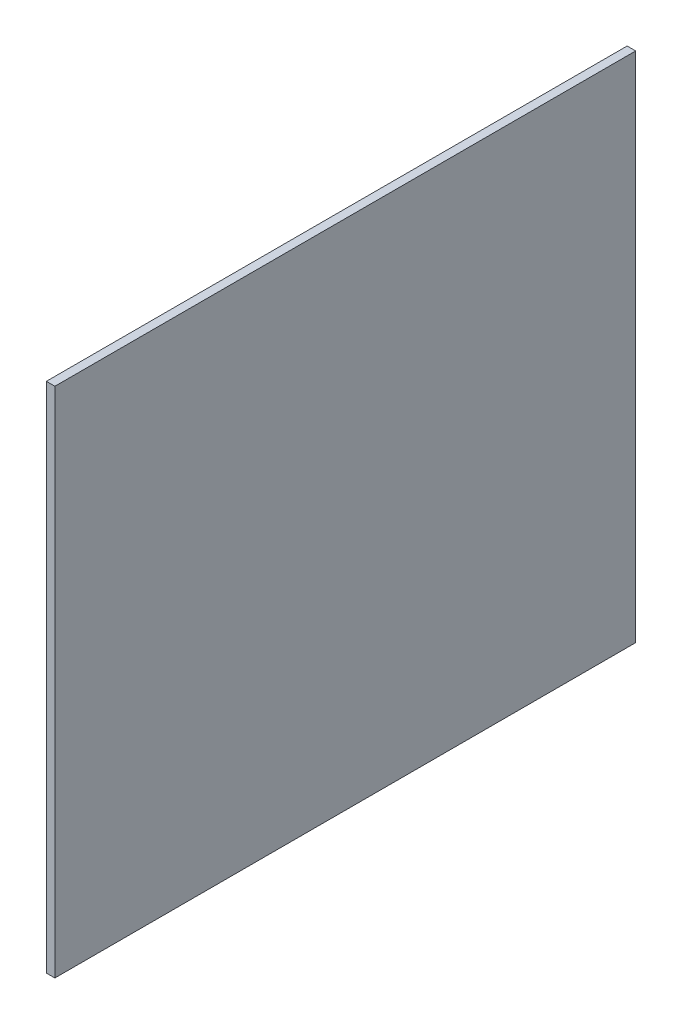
ISO-10303-21;
HEADER;
FILE_DESCRIPTION(('STEP AP214'),'2;1');
FILE_NAME('part.step','',(''),(''),'','','');
FILE_SCHEMA(('AUTOMOTIVE_DESIGN { 1 0 10303 214 1 1 1 1 }'));
ENDSEC;
DATA;
#1=APPLICATION_CONTEXT('core data for automotive mechanical design processes');
#2=APPLICATION_PROTOCOL_DEFINITION('international standard','automotive_design',2000,#1);
#3=PRODUCT_CONTEXT('',#1,'mechanical');
#4=PRODUCT('Part','Part','',(#3));
#5=PRODUCT_RELATED_PRODUCT_CATEGORY('part','',(#4));
#6=PRODUCT_DEFINITION_FORMATION('','',#4);
#7=PRODUCT_DEFINITION_CONTEXT('part definition',#1,'design');
#8=PRODUCT_DEFINITION('design','',#6,#7);
#9=PRODUCT_DEFINITION_SHAPE('','',#8);
#10=(LENGTH_UNIT() NAMED_UNIT(*) SI_UNIT(.MILLI.,.METRE.));
#11=(NAMED_UNIT(*) PLANE_ANGLE_UNIT() SI_UNIT($,.RADIAN.));
#12=(NAMED_UNIT(*) SI_UNIT($,.STERADIAN.) SOLID_ANGLE_UNIT());
#13=UNCERTAINTY_MEASURE_WITH_UNIT(LENGTH_MEASURE(1.E-05),#10,'distance_accuracy_value','');
#14=(GEOMETRIC_REPRESENTATION_CONTEXT(3) GLOBAL_UNCERTAINTY_ASSIGNED_CONTEXT((#13)) GLOBAL_UNIT_ASSIGNED_CONTEXT((#10,
#11,#12)) REPRESENTATION_CONTEXT('',''));
#15=CARTESIAN_POINT('',(0.,0.,0.));
#16=DIRECTION('',(0.,0.,1.));
#17=DIRECTION('',(1.,0.,0.));
#18=AXIS2_PLACEMENT_3D('',#15,#16,#17);
#19=CARTESIAN_POINT('',(-1.47104550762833E-12,190.5,215.9));
#20=DIRECTION('',(0.,-1.,0.));
#21=DIRECTION('',(0.,0.,-1.));
#22=AXIS2_PLACEMENT_3D('',#19,#20,#21);
#23=PLANE('',#22);
#24=DIRECTION('',(-1.,0.,0.));
#25=VECTOR('',#24,1.);
#26=CARTESIAN_POINT('',(0.,190.499999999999,-215.9));
#27=LINE('',#26,#25);
#28=CARTESIAN_POINT('',(6.35000000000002,190.499999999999,-215.9));
#29=VERTEX_POINT('',#28);
#30=CARTESIAN_POINT('',(0.,190.499999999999,-215.9));
#31=VERTEX_POINT('',#30);
#32=EDGE_CURVE('E94',#29,#31,#27,.T.);
#33=ORIENTED_EDGE('',*,*,#32,.T.);
#34=DIRECTION('',(0.,0.,-1.));
#35=VECTOR('',#34,1.);
#36=CARTESIAN_POINT('',(-1.47104550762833E-12,190.5,215.9));
#37=LINE('',#36,#35);
#38=CARTESIAN_POINT('',(-1.47104550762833E-12,190.5,215.9));
#39=VERTEX_POINT('',#38);
#40=EDGE_CURVE('E11',#39,#31,#37,.T.);
#41=ORIENTED_EDGE('',*,*,#40,.F.);
#42=DIRECTION('',(-1.,0.,0.));
#43=VECTOR('',#42,1.);
#44=CARTESIAN_POINT('',(-1.47104550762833E-12,190.5,215.9));
#45=LINE('',#44,#43);
#46=CARTESIAN_POINT('',(6.34999999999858,190.5,215.9));
#47=VERTEX_POINT('',#46);
#48=EDGE_CURVE('E82',#47,#39,#45,.T.);
#49=ORIENTED_EDGE('',*,*,#48,.F.);
#50=DIRECTION('',(0.,0.,-1.));
#51=VECTOR('',#50,1.);
#52=CARTESIAN_POINT('',(6.34999999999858,190.5,215.9));
#53=LINE('',#52,#51);
#54=EDGE_CURVE('E90',#47,#29,#53,.T.);
#55=ORIENTED_EDGE('',*,*,#54,.T.);
#56=EDGE_LOOP('',(#33,#41,#49,#55));
#57=FACE_BOUND('',#56,.T.);
#58=ADVANCED_FACE('F31',(#57),#23,.F.);
#59=CARTESIAN_POINT('',(-1.47104550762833E-12,-190.5,215.900000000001));
#60=DIRECTION('',(1.,0.,0.));
#61=DIRECTION('',(0.,0.,-1.));
#62=AXIS2_PLACEMENT_3D('',#59,#60,#61);
#63=PLANE('',#62);
#64=DIRECTION('',(0.,-1.,0.));
#65=VECTOR('',#64,1.);
#66=CARTESIAN_POINT('',(0.,-190.500000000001,-215.899999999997));
#67=LINE('',#66,#65);
#68=CARTESIAN_POINT('',(0.,-190.500000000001,-215.899999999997));
#69=VERTEX_POINT('',#68);
#70=EDGE_CURVE('E86',#31,#69,#67,.T.);
#71=ORIENTED_EDGE('',*,*,#70,.T.);
#72=DIRECTION('',(0.,0.,-1.));
#73=VECTOR('',#72,1.);
#74=CARTESIAN_POINT('',(-1.47104550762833E-12,-190.5,215.900000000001));
#75=LINE('',#74,#73);
#76=CARTESIAN_POINT('',(-1.47104550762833E-12,-190.5,215.900000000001));
#77=VERTEX_POINT('',#76);
#78=EDGE_CURVE('E39',#77,#69,#75,.T.);
#79=ORIENTED_EDGE('',*,*,#78,.F.);
#80=DIRECTION('',(0.,-1.,0.));
#81=VECTOR('',#80,1.);
#82=CARTESIAN_POINT('',(-1.47104550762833E-12,-190.5,215.900000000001));
#83=LINE('',#82,#81);
#84=EDGE_CURVE('E77',#39,#77,#83,.T.);
#85=ORIENTED_EDGE('',*,*,#84,.F.);
#86=ORIENTED_EDGE('',*,*,#40,.T.);
#87=EDGE_LOOP('',(#71,#79,#85,#86));
#88=FACE_BOUND('',#87,.T.);
#89=ADVANCED_FACE('F85',(#88),#63,.F.);
#90=CARTESIAN_POINT('',(-1.47104550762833E-12,-190.5,215.900000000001));
#91=DIRECTION('',(0.,1.,0.));
#92=DIRECTION('',(0.,0.,1.));
#93=AXIS2_PLACEMENT_3D('',#90,#91,#92);
#94=PLANE('',#93);
#95=DIRECTION('',(1.,0.,0.));
#96=VECTOR('',#95,1.);
#97=CARTESIAN_POINT('',(0.,-190.500000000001,-215.899999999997));
#98=LINE('',#97,#96);
#99=CARTESIAN_POINT('',(6.35000000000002,-190.500000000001,-215.899999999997));
#100=VERTEX_POINT('',#99);
#101=EDGE_CURVE('E64',#69,#100,#98,.T.);
#102=ORIENTED_EDGE('',*,*,#101,.T.);
#103=DIRECTION('',(0.,0.,-1.));
#104=VECTOR('',#103,1.);
#105=CARTESIAN_POINT('',(6.34999999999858,-190.5,215.900000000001));
#106=LINE('',#105,#104);
#107=CARTESIAN_POINT('',(6.34999999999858,-190.5,215.900000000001));
#108=VERTEX_POINT('',#107);
#109=EDGE_CURVE('E87',#108,#100,#106,.T.);
#110=ORIENTED_EDGE('',*,*,#109,.F.);
#111=DIRECTION('',(1.,0.,0.));
#112=VECTOR('',#111,1.);
#113=CARTESIAN_POINT('',(-1.47104550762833E-12,-190.5,215.900000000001));
#114=LINE('',#113,#112);
#115=EDGE_CURVE('E80',#77,#108,#114,.T.);
#116=ORIENTED_EDGE('',*,*,#115,.F.);
#117=ORIENTED_EDGE('',*,*,#78,.T.);
#118=EDGE_LOOP('',(#102,#110,#116,#117));
#119=FACE_BOUND('',#118,.T.);
#120=ADVANCED_FACE('F88',(#119),#94,.F.);
#121=CARTESIAN_POINT('',(6.34999999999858,190.5,215.9));
#122=DIRECTION('',(-1.,0.,0.));
#123=DIRECTION('',(0.,0.,1.));
#124=AXIS2_PLACEMENT_3D('',#121,#122,#123);
#125=PLANE('',#124);
#126=DIRECTION('',(0.,1.,0.));
#127=VECTOR('',#126,1.);
#128=CARTESIAN_POINT('',(6.35000000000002,190.499999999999,-215.9));
#129=LINE('',#128,#127);
#130=EDGE_CURVE('E70',#100,#29,#129,.T.);
#131=ORIENTED_EDGE('',*,*,#130,.T.);
#132=ORIENTED_EDGE('',*,*,#54,.F.);
#133=DIRECTION('',(0.,1.,0.));
#134=VECTOR('',#133,1.);
#135=CARTESIAN_POINT('',(6.34999999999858,190.5,215.9));
#136=LINE('',#135,#134);
#137=EDGE_CURVE('E47',#108,#47,#136,.T.);
#138=ORIENTED_EDGE('',*,*,#137,.F.);
#139=ORIENTED_EDGE('',*,*,#109,.T.);
#140=EDGE_LOOP('',(#131,#132,#138,#139));
#141=FACE_BOUND('',#140,.T.);
#142=ADVANCED_FACE('F101',(#141),#125,.F.);
#143=CARTESIAN_POINT('',(6.34999999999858,190.5,215.9));
#144=DIRECTION('',(0.,0.,-1.));
#145=DIRECTION('',(-1.,0.,0.));
#146=AXIS2_PLACEMENT_3D('',#143,#144,#145);
#147=PLANE('',#146);
#148=ORIENTED_EDGE('',*,*,#48,.T.);
#149=ORIENTED_EDGE('',*,*,#84,.T.);
#150=ORIENTED_EDGE('',*,*,#115,.T.);
#151=ORIENTED_EDGE('',*,*,#137,.T.);
#152=EDGE_LOOP('',(#148,#149,#150,#151));
#153=FACE_BOUND('',#152,.T.);
#154=ADVANCED_FACE('F78',(#153),#147,.F.);
#155=CARTESIAN_POINT('',(6.35000000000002,190.499999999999,-215.9));
#156=DIRECTION('',(0.,0.,-1.));
#157=DIRECTION('',(-1.,0.,0.));
#158=AXIS2_PLACEMENT_3D('',#155,#156,#157);
#159=PLANE('',#158);
#160=ORIENTED_EDGE('',*,*,#32,.F.);
#161=ORIENTED_EDGE('',*,*,#130,.F.);
#162=ORIENTED_EDGE('',*,*,#101,.F.);
#163=ORIENTED_EDGE('',*,*,#70,.F.);
#164=EDGE_LOOP('',(#160,#161,#162,#163));
#165=FACE_BOUND('',#164,.T.);
#166=ADVANCED_FACE('F104',(#165),#159,.T.);
#167=CLOSED_SHELL('',(#58,#89,#120,#142,#154,#166));
#168=MANIFOLD_SOLID_BREP('B2',#167);
#169=ADVANCED_BREP_SHAPE_REPRESENTATION('',(#18,#168),#14);
#170=SHAPE_DEFINITION_REPRESENTATION(#9,#169);
ENDSEC;
END-ISO-10303-21;
